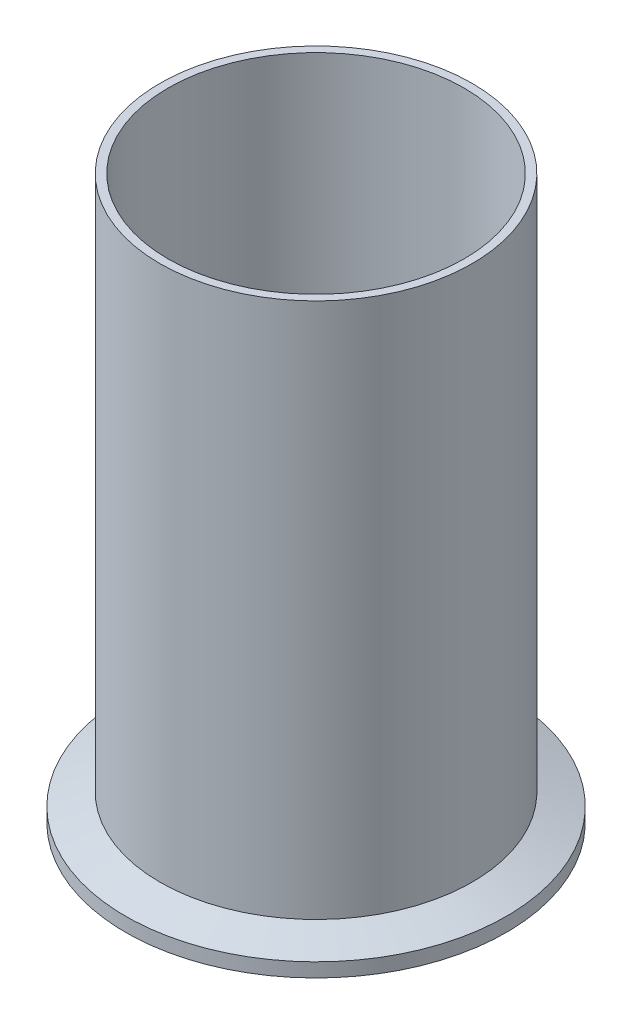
from build123d import *


with BuildPart() as part:
    # Sketch1 → Revolve2 (revolve)
    with BuildSketch(Plane.XY, mode=Mode.PRIVATE) as revolve2_sk:
        with BuildLine():
            Line((-30.099, 0), (-30.099, 114.3))
            Line((-30.099, 114.3), (-31.75, 114.3))
            Line((-31.75, 114.3), (-31.75, 5.377887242))
            Line((-31.75, 5.377887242), (-38.7096, 2.8448))
            Line((-38.7096, 2.8448), (-38.7096, 0))
            Line((-38.7096, 0), (-37.136708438, 0))
            ThreePointArc((-37.136708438, 0), (-36.704511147, 0.129217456), (-36.414166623, 0.474458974))
            ThreePointArc((-36.414166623, 0.474458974), (-35.3187, 1.1938), (-34.223233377, 0.474458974))
            ThreePointArc((-34.223233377, 0.474458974), (-33.932888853, 0.129217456), (-33.500691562, 0))
            Line((-33.500691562, 0), (-30.099, 0))
        make_face()
    revolve(revolve2_sk.sketch.rotate(Axis((0, 0, 0), (0, 1, 0)), 270), axis=Axis((0, 0, 0), (0, 1, 0)))


solid = part.part
